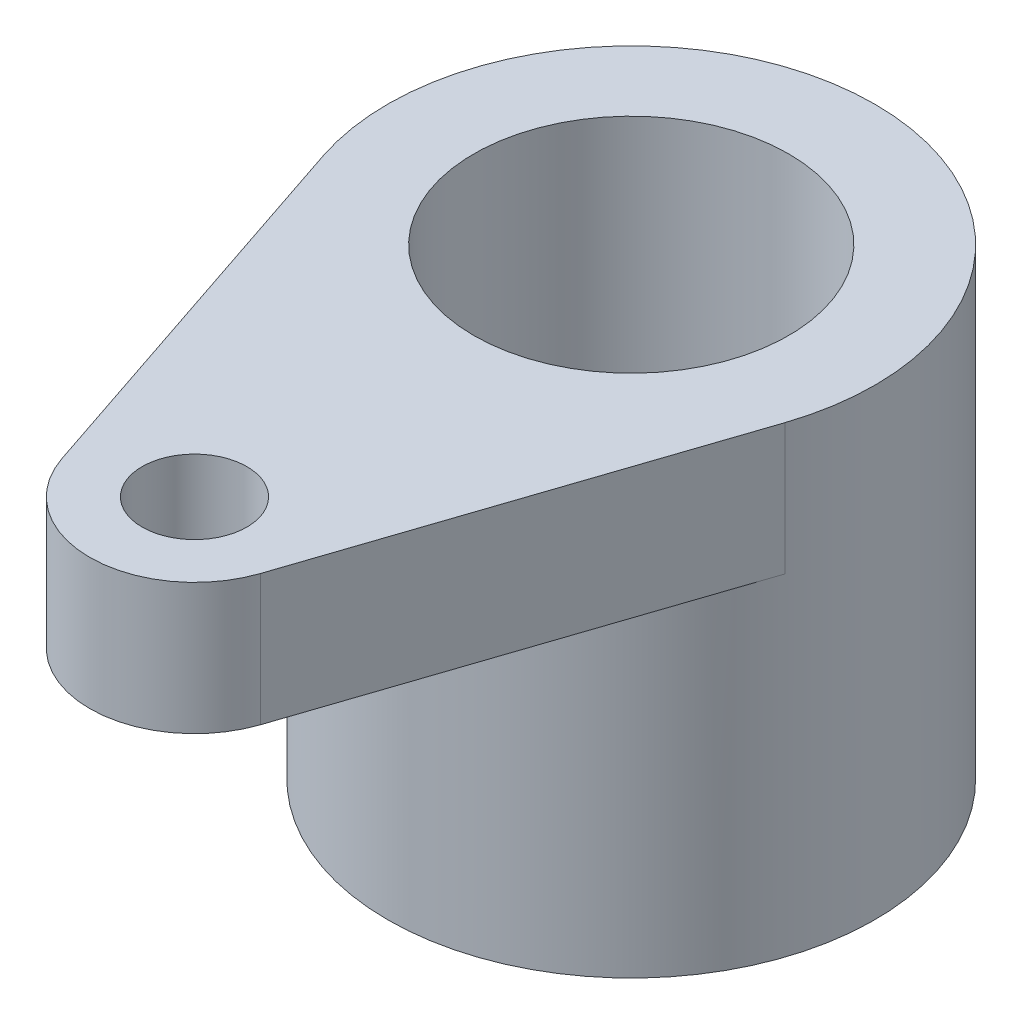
ISO-10303-21;
HEADER;
FILE_DESCRIPTION(('STEP AP214'),'2;1');
FILE_NAME('part.step','',(''),(''),'','','');
FILE_SCHEMA(('AUTOMOTIVE_DESIGN { 1 0 10303 214 1 1 1 1 }'));
ENDSEC;
DATA;
#1=APPLICATION_CONTEXT('core data for automotive mechanical design processes');
#2=APPLICATION_PROTOCOL_DEFINITION('international standard','automotive_design',2000,#1);
#3=PRODUCT_CONTEXT('',#1,'mechanical');
#4=PRODUCT('Part','Part','',(#3));
#5=PRODUCT_RELATED_PRODUCT_CATEGORY('part','',(#4));
#6=PRODUCT_DEFINITION_FORMATION('','',#4);
#7=PRODUCT_DEFINITION_CONTEXT('part definition',#1,'design');
#8=PRODUCT_DEFINITION('design','',#6,#7);
#9=PRODUCT_DEFINITION_SHAPE('','',#8);
#10=(LENGTH_UNIT() NAMED_UNIT(*) SI_UNIT(.MILLI.,.METRE.));
#11=(NAMED_UNIT(*) PLANE_ANGLE_UNIT() SI_UNIT($,.RADIAN.));
#12=(NAMED_UNIT(*) SI_UNIT($,.STERADIAN.) SOLID_ANGLE_UNIT());
#13=UNCERTAINTY_MEASURE_WITH_UNIT(LENGTH_MEASURE(1.E-05),#10,'distance_accuracy_value','');
#14=(GEOMETRIC_REPRESENTATION_CONTEXT(3) GLOBAL_UNCERTAINTY_ASSIGNED_CONTEXT((#13)) GLOBAL_UNIT_ASSIGNED_CONTEXT((#10,
#11,#12)) REPRESENTATION_CONTEXT('',''));
#15=CARTESIAN_POINT('',(0.,0.,0.));
#16=DIRECTION('',(0.,0.,1.));
#17=DIRECTION('',(1.,0.,0.));
#18=AXIS2_PLACEMENT_3D('',#15,#16,#17);
#19=CARTESIAN_POINT('',(0.,-53.,0.));
#20=DIRECTION('',(0.,1.,0.));
#21=DIRECTION('',(0.,0.,1.));
#22=AXIS2_PLACEMENT_3D('',#19,#20,#21);
#23=CYLINDRICAL_SURFACE('',#22,27.8802337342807);
#24=DIRECTION('',(0.,1.,0.));
#25=VECTOR('',#24,1.);
#26=CARTESIAN_POINT('',(-26.4366849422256,-15.,8.8548925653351));
#27=LINE('',#26,#25);
#28=CARTESIAN_POINT('',(-26.4366849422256,-15.,8.8548925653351));
#29=VERTEX_POINT('',#28);
#30=CARTESIAN_POINT('',(-26.4366849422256,0.,8.8548925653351));
#31=VERTEX_POINT('',#30);
#32=EDGE_CURVE('E94',#29,#31,#27,.T.);
#33=ORIENTED_EDGE('',*,*,#32,.T.);
#34=CARTESIAN_POINT('',(0.,0.,0.));
#35=DIRECTION('',(0.,1.,0.));
#36=DIRECTION('',(0.,0.,1.));
#37=AXIS2_PLACEMENT_3D('',#34,#35,#36);
#38=CIRCLE('',#37,27.8802337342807);
#39=CARTESIAN_POINT('',(26.4366849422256,0.,8.85489256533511));
#40=VERTEX_POINT('',#39);
#41=EDGE_CURVE('E34',#40,#31,#38,.T.);
#42=ORIENTED_EDGE('',*,*,#41,.F.);
#43=DIRECTION('',(0.,1.,0.));
#44=VECTOR('',#43,1.);
#45=CARTESIAN_POINT('',(26.4366849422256,-15.,8.85489256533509));
#46=LINE('',#45,#44);
#47=CARTESIAN_POINT('',(26.4366849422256,-15.,8.85489256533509));
#48=VERTEX_POINT('',#47);
#49=EDGE_CURVE('E89',#48,#40,#46,.T.);
#50=ORIENTED_EDGE('',*,*,#49,.F.);
#51=CARTESIAN_POINT('',(0.,-15.,0.));
#52=DIRECTION('',(0.,-1.,0.));
#53=DIRECTION('',(0.,0.,1.));
#54=AXIS2_PLACEMENT_3D('',#51,#52,#53);
#55=CIRCLE('',#54,27.8802337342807);
#56=EDGE_CURVE('E80',#48,#29,#55,.T.);
#57=ORIENTED_EDGE('',*,*,#56,.T.);
#58=EDGE_LOOP('',(#33,#42,#50,#57));
#59=FACE_BOUND('',#58,.T.);
#60=CARTESIAN_POINT('',(0.,-53.,0.));
#61=DIRECTION('',(0.,1.,0.));
#62=DIRECTION('',(0.,0.,1.));
#63=AXIS2_PLACEMENT_3D('',#60,#61,#62);
#64=CIRCLE('',#63,27.8802337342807);
#65=CARTESIAN_POINT('',(0.,-53.,27.8802337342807));
#66=VERTEX_POINT('',#65);
#67=EDGE_CURVE('E11',#66,#66,#64,.T.);
#68=ORIENTED_EDGE('',*,*,#67,.T.);
#69=EDGE_LOOP('',(#68));
#70=FACE_BOUND('',#69,.T.);
#71=ADVANCED_FACE('F31',(#59,#70),#23,.T.);
#72=CARTESIAN_POINT('',(0.,-53.,0.));
#73=DIRECTION('',(0.,1.,0.));
#74=DIRECTION('',(0.,0.,1.));
#75=AXIS2_PLACEMENT_3D('',#72,#73,#74);
#76=PLANE('',#75);
#77=CARTESIAN_POINT('',(0.,-53.,0.));
#78=DIRECTION('',(0.,1.,0.));
#79=DIRECTION('',(0.,0.,1.));
#80=AXIS2_PLACEMENT_3D('',#77,#78,#79);
#81=CIRCLE('',#80,18.0230587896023);
#82=CARTESIAN_POINT('',(0.,-53.,18.0230587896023));
#83=VERTEX_POINT('',#82);
#84=EDGE_CURVE('E100',#83,#83,#81,.T.);
#85=ORIENTED_EDGE('',*,*,#84,.T.);
#86=EDGE_LOOP('',(#85));
#87=FACE_BOUND('',#86,.T.);
#88=ORIENTED_EDGE('',*,*,#67,.F.);
#89=EDGE_LOOP('',(#88));
#90=FACE_BOUND('',#89,.T.);
#91=ADVANCED_FACE('F133',(#87,#90),#76,.F.);
#92=CARTESIAN_POINT('',(0.,0.,0.));
#93=DIRECTION('',(0.,1.,0.));
#94=DIRECTION('',(0.,0.,1.));
#95=AXIS2_PLACEMENT_3D('',#92,#93,#94);
#96=PLANE('',#95);
#97=CARTESIAN_POINT('',(0.,0.,0.));
#98=DIRECTION('',(0.,1.,0.));
#99=DIRECTION('',(0.,0.,1.));
#100=AXIS2_PLACEMENT_3D('',#97,#98,#99);
#101=CIRCLE('',#100,18.0230587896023);
#102=CARTESIAN_POINT('',(0.,0.,18.0230587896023));
#103=VERTEX_POINT('',#102);
#104=EDGE_CURVE('E103',#103,#103,#101,.T.);
#105=ORIENTED_EDGE('',*,*,#104,.F.);
#106=EDGE_LOOP('',(#105));
#107=FACE_BOUND('',#106,.T.);
#108=ORIENTED_EDGE('',*,*,#41,.T.);
#109=DIRECTION('',(0.317604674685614,0.,0.948223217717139));
#110=VECTOR('',#109,1.);
#111=CARTESIAN_POINT('',(-26.4366849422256,0.,8.8548925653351));
#112=LINE('',#111,#110);
#113=CARTESIAN_POINT('',(-11.3786786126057,0.,53.8112560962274));
#114=VERTEX_POINT('',#113);
#115=EDGE_CURVE('E108',#31,#114,#112,.T.);
#116=ORIENTED_EDGE('',*,*,#115,.T.);
#117=CARTESIAN_POINT('',(0.,0.,50.));
#118=DIRECTION('',(0.,1.,0.));
#119=DIRECTION('',(0.,0.,1.));
#120=AXIS2_PLACEMENT_3D('',#117,#118,#119);
#121=CIRCLE('',#120,12.);
#122=CARTESIAN_POINT('',(11.3786786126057,0.,53.8112560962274));
#123=VERTEX_POINT('',#122);
#124=EDGE_CURVE('E112',#114,#123,#121,.T.);
#125=ORIENTED_EDGE('',*,*,#124,.T.);
#126=DIRECTION('',(0.317604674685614,0.,-0.948223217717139));
#127=VECTOR('',#126,1.);
#128=CARTESIAN_POINT('',(26.4366849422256,0.,8.8548925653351));
#129=LINE('',#128,#127);
#130=EDGE_CURVE('E45',#123,#40,#129,.T.);
#131=ORIENTED_EDGE('',*,*,#130,.T.);
#132=EDGE_LOOP('',(#108,#116,#125,#131));
#133=FACE_BOUND('',#132,.T.);
#134=CARTESIAN_POINT('',(0.,0.,50.));
#135=DIRECTION('',(0.,1.,0.));
#136=DIRECTION('',(0.,0.,1.));
#137=AXIS2_PLACEMENT_3D('',#134,#135,#136);
#138=CIRCLE('',#137,6.);
#139=CARTESIAN_POINT('',(0.,0.,56.));
#140=VERTEX_POINT('',#139);
#141=EDGE_CURVE('E117',#140,#140,#138,.T.);
#142=ORIENTED_EDGE('',*,*,#141,.F.);
#143=EDGE_LOOP('',(#142));
#144=FACE_BOUND('',#143,.T.);
#145=ADVANCED_FACE('F130',(#107,#133,#144),#96,.T.);
#146=CARTESIAN_POINT('',(0.,-53.,0.));
#147=DIRECTION('',(0.,1.,0.));
#148=DIRECTION('',(0.,0.,1.));
#149=AXIS2_PLACEMENT_3D('',#146,#147,#148);
#150=CYLINDRICAL_SURFACE('',#149,18.0230587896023);
#151=ORIENTED_EDGE('',*,*,#84,.F.);
#152=EDGE_LOOP('',(#151));
#153=FACE_BOUND('',#152,.T.);
#154=ORIENTED_EDGE('',*,*,#104,.T.);
#155=EDGE_LOOP('',(#154));
#156=FACE_BOUND('',#155,.T.);
#157=ADVANCED_FACE('F132',(#153,#156),#150,.F.);
#158=CARTESIAN_POINT('',(0.,-15.,50.));
#159=DIRECTION('',(0.,1.,0.));
#160=DIRECTION('',(0.,0.,1.));
#161=AXIS2_PLACEMENT_3D('',#158,#159,#160);
#162=CYLINDRICAL_SURFACE('',#161,12.);
#163=ORIENTED_EDGE('',*,*,#124,.F.);
#164=DIRECTION('',(0.,1.,0.));
#165=VECTOR('',#164,1.);
#166=CARTESIAN_POINT('',(-11.3786786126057,-15.,53.8112560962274));
#167=LINE('',#166,#165);
#168=CARTESIAN_POINT('',(-11.3786786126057,-15.,53.8112560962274));
#169=VERTEX_POINT('',#168);
#170=EDGE_CURVE('E54',#169,#114,#167,.T.);
#171=ORIENTED_EDGE('',*,*,#170,.F.);
#172=CARTESIAN_POINT('',(0.,-15.,50.));
#173=DIRECTION('',(0.,1.,0.));
#174=DIRECTION('',(0.,0.,1.));
#175=AXIS2_PLACEMENT_3D('',#172,#173,#174);
#176=CIRCLE('',#175,12.);
#177=CARTESIAN_POINT('',(11.3786786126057,-15.,53.8112560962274));
#178=VERTEX_POINT('',#177);
#179=EDGE_CURVE('E91',#169,#178,#176,.T.);
#180=ORIENTED_EDGE('',*,*,#179,.T.);
#181=DIRECTION('',(0.,1.,0.));
#182=VECTOR('',#181,1.);
#183=CARTESIAN_POINT('',(11.3786786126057,-15.,53.8112560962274));
#184=LINE('',#183,#182);
#185=EDGE_CURVE('E74',#178,#123,#184,.T.);
#186=ORIENTED_EDGE('',*,*,#185,.T.);
#187=EDGE_LOOP('',(#163,#171,#180,#186));
#188=FACE_BOUND('',#187,.T.);
#189=ADVANCED_FACE('F139',(#188),#162,.T.);
#190=CARTESIAN_POINT('',(-26.4366849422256,-15.,8.8548925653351));
#191=DIRECTION('',(-0.948223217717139,0.,0.317604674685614));
#192=DIRECTION('',(0.317604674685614,0.,0.948223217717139));
#193=AXIS2_PLACEMENT_3D('',#190,#191,#192);
#194=PLANE('',#193);
#195=ORIENTED_EDGE('',*,*,#115,.F.);
#196=ORIENTED_EDGE('',*,*,#32,.F.);
#197=DIRECTION('',(0.317604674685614,0.,0.948223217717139));
#198=VECTOR('',#197,1.);
#199=CARTESIAN_POINT('',(-26.4366849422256,-15.,8.8548925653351));
#200=LINE('',#199,#198);
#201=EDGE_CURVE('E83',#29,#169,#200,.T.);
#202=ORIENTED_EDGE('',*,*,#201,.T.);
#203=ORIENTED_EDGE('',*,*,#170,.T.);
#204=EDGE_LOOP('',(#195,#196,#202,#203));
#205=FACE_BOUND('',#204,.T.);
#206=ADVANCED_FACE('F167',(#205),#194,.T.);
#207=CARTESIAN_POINT('',(26.4366849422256,-15.,8.8548925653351));
#208=DIRECTION('',(0.948223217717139,0.,0.317604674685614));
#209=DIRECTION('',(0.317604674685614,0.,-0.948223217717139));
#210=AXIS2_PLACEMENT_3D('',#207,#208,#209);
#211=PLANE('',#210);
#212=ORIENTED_EDGE('',*,*,#130,.F.);
#213=ORIENTED_EDGE('',*,*,#185,.F.);
#214=DIRECTION('',(0.317604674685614,0.,-0.948223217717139));
#215=VECTOR('',#214,1.);
#216=CARTESIAN_POINT('',(26.4366849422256,-15.,8.8548925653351));
#217=LINE('',#216,#215);
#218=EDGE_CURVE('E82',#178,#48,#217,.T.);
#219=ORIENTED_EDGE('',*,*,#218,.T.);
#220=ORIENTED_EDGE('',*,*,#49,.T.);
#221=EDGE_LOOP('',(#212,#213,#219,#220));
#222=FACE_BOUND('',#221,.T.);
#223=ADVANCED_FACE('F88',(#222),#211,.T.);
#224=CARTESIAN_POINT('',(0.,-15.,50.));
#225=DIRECTION('',(0.,1.,0.));
#226=DIRECTION('',(0.,0.,1.));
#227=AXIS2_PLACEMENT_3D('',#224,#225,#226);
#228=PLANE('',#227);
#229=CARTESIAN_POINT('',(0.,-15.,50.));
#230=DIRECTION('',(0.,1.,0.));
#231=DIRECTION('',(0.,0.,1.));
#232=AXIS2_PLACEMENT_3D('',#229,#230,#231);
#233=CIRCLE('',#232,6.);
#234=CARTESIAN_POINT('',(0.,-15.,56.));
#235=VERTEX_POINT('',#234);
#236=EDGE_CURVE('E114',#235,#235,#233,.T.);
#237=ORIENTED_EDGE('',*,*,#236,.T.);
#238=EDGE_LOOP('',(#237));
#239=FACE_BOUND('',#238,.T.);
#240=ORIENTED_EDGE('',*,*,#179,.F.);
#241=ORIENTED_EDGE('',*,*,#201,.F.);
#242=ORIENTED_EDGE('',*,*,#56,.F.);
#243=ORIENTED_EDGE('',*,*,#218,.F.);
#244=EDGE_LOOP('',(#240,#241,#242,#243));
#245=FACE_BOUND('',#244,.T.);
#246=ADVANCED_FACE('F81',(#239,#245),#228,.F.);
#247=CARTESIAN_POINT('',(0.,-15.,50.));
#248=DIRECTION('',(0.,1.,0.));
#249=DIRECTION('',(0.,0.,1.));
#250=AXIS2_PLACEMENT_3D('',#247,#248,#249);
#251=CYLINDRICAL_SURFACE('',#250,6.);
#252=ORIENTED_EDGE('',*,*,#236,.F.);
#253=EDGE_LOOP('',(#252));
#254=FACE_BOUND('',#253,.T.);
#255=ORIENTED_EDGE('',*,*,#141,.T.);
#256=EDGE_LOOP('',(#255));
#257=FACE_BOUND('',#256,.T.);
#258=ADVANCED_FACE('F124',(#254,#257),#251,.F.);
#259=CLOSED_SHELL('',(#71,#91,#145,#157,#189,#206,#223,#246,#258));
#260=MANIFOLD_SOLID_BREP('B2',#259);
#261=ADVANCED_BREP_SHAPE_REPRESENTATION('',(#18,#260),#14);
#262=SHAPE_DEFINITION_REPRESENTATION(#9,#261);
ENDSEC;
END-ISO-10303-21;
